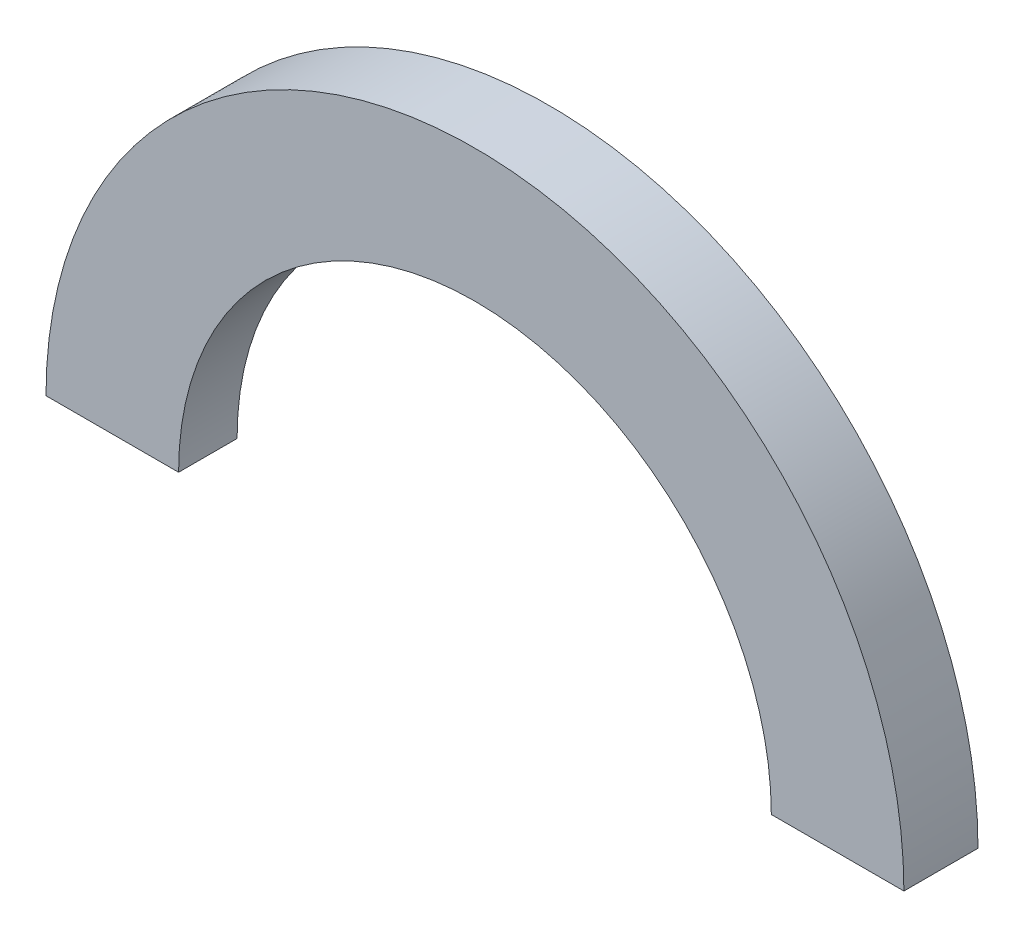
ISO-10303-21;
HEADER;
FILE_DESCRIPTION(('STEP AP214'),'2;1');
FILE_NAME('part.step','',(''),(''),'','','');
FILE_SCHEMA(('AUTOMOTIVE_DESIGN { 1 0 10303 214 1 1 1 1 }'));
ENDSEC;
DATA;
#1=APPLICATION_CONTEXT('core data for automotive mechanical design processes');
#2=APPLICATION_PROTOCOL_DEFINITION('international standard','automotive_design',2000,#1);
#3=PRODUCT_CONTEXT('',#1,'mechanical');
#4=PRODUCT('Part','Part','',(#3));
#5=PRODUCT_RELATED_PRODUCT_CATEGORY('part','',(#4));
#6=PRODUCT_DEFINITION_FORMATION('','',#4);
#7=PRODUCT_DEFINITION_CONTEXT('part definition',#1,'design');
#8=PRODUCT_DEFINITION('design','',#6,#7);
#9=PRODUCT_DEFINITION_SHAPE('','',#8);
#10=(LENGTH_UNIT() NAMED_UNIT(*) SI_UNIT(.MILLI.,.METRE.));
#11=(NAMED_UNIT(*) PLANE_ANGLE_UNIT() SI_UNIT($,.RADIAN.));
#12=(NAMED_UNIT(*) SI_UNIT($,.STERADIAN.) SOLID_ANGLE_UNIT());
#13=UNCERTAINTY_MEASURE_WITH_UNIT(LENGTH_MEASURE(1.E-05),#10,'distance_accuracy_value','');
#14=(GEOMETRIC_REPRESENTATION_CONTEXT(3) GLOBAL_UNCERTAINTY_ASSIGNED_CONTEXT((#13)) GLOBAL_UNIT_ASSIGNED_CONTEXT((#10,
#11,#12)) REPRESENTATION_CONTEXT('',''));
#15=CARTESIAN_POINT('',(0.,0.,0.));
#16=DIRECTION('',(0.,0.,1.));
#17=DIRECTION('',(1.,0.,0.));
#18=AXIS2_PLACEMENT_3D('',#15,#16,#17);
#19=CARTESIAN_POINT('',(0.,0.,0.));
#20=DIRECTION('',(0.,0.,1.));
#21=DIRECTION('',(1.,0.,0.));
#22=AXIS2_PLACEMENT_3D('',#19,#20,#21);
#23=PLANE('',#22);
#24=CARTESIAN_POINT('',(0.,0.,0.));
#25=DIRECTION('',(0.,0.,1.));
#26=DIRECTION('',(1.,0.,0.));
#27=AXIS2_PLACEMENT_3D('',#24,#25,#26);
#28=CIRCLE('',#27,55.);
#29=CARTESIAN_POINT('',(55.,0.,0.));
#30=VERTEX_POINT('',#29);
#31=CARTESIAN_POINT('',(-55.,0.,0.));
#32=VERTEX_POINT('',#31);
#33=EDGE_CURVE('E108',#30,#32,#28,.T.);
#34=ORIENTED_EDGE('',*,*,#33,.F.);
#35=DIRECTION('',(-1.,0.,0.));
#36=VECTOR('',#35,1.);
#37=CARTESIAN_POINT('',(-60.0066934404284,0.,0.));
#38=LINE('',#37,#36);
#39=CARTESIAN_POINT('',(41.,0.,0.));
#40=VERTEX_POINT('',#39);
#41=EDGE_CURVE('E88',#30,#40,#38,.T.);
#42=ORIENTED_EDGE('',*,*,#41,.T.);
#43=CARTESIAN_POINT('',(0.,0.,0.));
#44=DIRECTION('',(0.,0.,1.));
#45=DIRECTION('',(1.,0.,0.));
#46=AXIS2_PLACEMENT_3D('',#43,#44,#45);
#47=CIRCLE('',#46,41.);
#48=CARTESIAN_POINT('',(-41.,0.,0.));
#49=VERTEX_POINT('',#48);
#50=EDGE_CURVE('E93',#40,#49,#47,.T.);
#51=ORIENTED_EDGE('',*,*,#50,.T.);
#52=EDGE_CURVE('E104',#49,#32,#38,.T.);
#53=ORIENTED_EDGE('',*,*,#52,.T.);
#54=EDGE_LOOP('',(#34,#42,#51,#53));
#55=FACE_BOUND('',#54,.T.);
#56=ADVANCED_FACE('F33',(#55),#23,.F.);
#57=CARTESIAN_POINT('',(0.,0.,9.5));
#58=DIRECTION('',(0.,0.,1.));
#59=DIRECTION('',(1.,0.,0.));
#60=AXIS2_PLACEMENT_3D('',#57,#58,#59);
#61=PLANE('',#60);
#62=DIRECTION('',(-1.,0.,0.));
#63=VECTOR('',#62,1.);
#64=CARTESIAN_POINT('',(-60.0066934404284,0.,9.5));
#65=LINE('',#64,#63);
#66=CARTESIAN_POINT('',(55.,0.,9.5));
#67=VERTEX_POINT('',#66);
#68=CARTESIAN_POINT('',(38.,0.,9.5));
#69=VERTEX_POINT('',#68);
#70=EDGE_CURVE('E86',#67,#69,#65,.T.);
#71=ORIENTED_EDGE('',*,*,#70,.F.);
#72=CARTESIAN_POINT('',(0.,0.,9.5));
#73=DIRECTION('',(0.,0.,1.));
#74=DIRECTION('',(1.,0.,0.));
#75=AXIS2_PLACEMENT_3D('',#72,#73,#74);
#76=CIRCLE('',#75,55.);
#77=CARTESIAN_POINT('',(-55.,0.,9.5));
#78=VERTEX_POINT('',#77);
#79=EDGE_CURVE('E101',#67,#78,#76,.T.);
#80=ORIENTED_EDGE('',*,*,#79,.T.);
#81=CARTESIAN_POINT('',(-38.,0.,9.5));
#82=VERTEX_POINT('',#81);
#83=EDGE_CURVE('E105',#82,#78,#65,.T.);
#84=ORIENTED_EDGE('',*,*,#83,.F.);
#85=CARTESIAN_POINT('',(0.,0.,9.5));
#86=DIRECTION('',(0.,0.,1.));
#87=DIRECTION('',(1.,0.,0.));
#88=AXIS2_PLACEMENT_3D('',#85,#86,#87);
#89=CIRCLE('',#88,38.);
#90=EDGE_CURVE('E103',#69,#82,#89,.T.);
#91=ORIENTED_EDGE('',*,*,#90,.F.);
#92=EDGE_LOOP('',(#71,#80,#84,#91));
#93=FACE_BOUND('',#92,.T.);
#94=ADVANCED_FACE('F99',(#93),#61,.T.);
#95=CARTESIAN_POINT('',(0.,0.,9.5));
#96=DIRECTION('',(0.,0.,-1.));
#97=DIRECTION('',(-1.,0.,0.));
#98=AXIS2_PLACEMENT_3D('',#95,#96,#97);
#99=CYLINDRICAL_SURFACE('',#98,55.);
#100=ORIENTED_EDGE('',*,*,#79,.F.);
#101=DIRECTION('',(0.,0.,-1.));
#102=VECTOR('',#101,1.);
#103=CARTESIAN_POINT('',(55.,0.,9.5));
#104=LINE('',#103,#102);
#105=EDGE_CURVE('E83',#67,#30,#104,.T.);
#106=ORIENTED_EDGE('',*,*,#105,.T.);
#107=ORIENTED_EDGE('',*,*,#33,.T.);
#108=DIRECTION('',(0.,0.,-1.));
#109=VECTOR('',#108,1.);
#110=CARTESIAN_POINT('',(-55.,0.,9.5));
#111=LINE('',#110,#109);
#112=EDGE_CURVE('E94',#32,#78,#111,.F.);
#113=ORIENTED_EDGE('',*,*,#112,.T.);
#114=EDGE_LOOP('',(#100,#106,#107,#113));
#115=FACE_BOUND('',#114,.T.);
#116=ADVANCED_FACE('F35',(#115),#99,.T.);
#117=CARTESIAN_POINT('',(0.,0.,9.5));
#118=DIRECTION('',(0.,0.,-1.));
#119=DIRECTION('',(-1.,0.,0.));
#120=AXIS2_PLACEMENT_3D('',#117,#118,#119);
#121=CYLINDRICAL_SURFACE('',#120,38.);
#122=DIRECTION('',(0.,0.,-1.));
#123=VECTOR('',#122,1.);
#124=CARTESIAN_POINT('',(38.,0.,9.5));
#125=LINE('',#124,#123);
#126=CARTESIAN_POINT('',(38.,0.,2.));
#127=VERTEX_POINT('',#126);
#128=EDGE_CURVE('E56',#69,#127,#125,.T.);
#129=ORIENTED_EDGE('',*,*,#128,.F.);
#130=ORIENTED_EDGE('',*,*,#90,.T.);
#131=DIRECTION('',(0.,0.,-1.));
#132=VECTOR('',#131,1.);
#133=CARTESIAN_POINT('',(-38.,0.,9.5));
#134=LINE('',#133,#132);
#135=CARTESIAN_POINT('',(-38.,0.,2.));
#136=VERTEX_POINT('',#135);
#137=EDGE_CURVE('E129',#136,#82,#134,.F.);
#138=ORIENTED_EDGE('',*,*,#137,.F.);
#139=CARTESIAN_POINT('',(0.,0.,2.));
#140=DIRECTION('',(0.,0.,1.));
#141=DIRECTION('',(1.,0.,0.));
#142=AXIS2_PLACEMENT_3D('',#139,#140,#141);
#143=CIRCLE('',#142,38.);
#144=EDGE_CURVE('E112',#127,#136,#143,.T.);
#145=ORIENTED_EDGE('',*,*,#144,.F.);
#146=EDGE_LOOP('',(#129,#130,#138,#145));
#147=FACE_BOUND('',#146,.T.);
#148=ADVANCED_FACE('F140',(#147),#121,.F.);
#149=CARTESIAN_POINT('',(0.,0.,2.));
#150=DIRECTION('',(0.,0.,-1.));
#151=DIRECTION('',(-1.,0.,0.));
#152=AXIS2_PLACEMENT_3D('',#149,#150,#151);
#153=CYLINDRICAL_SURFACE('',#152,41.);
#154=DIRECTION('',(0.,0.,-1.));
#155=VECTOR('',#154,1.);
#156=CARTESIAN_POINT('',(41.,0.,2.));
#157=LINE('',#156,#155);
#158=CARTESIAN_POINT('',(41.,0.,2.));
#159=VERTEX_POINT('',#158);
#160=EDGE_CURVE('E127',#159,#40,#157,.T.);
#161=ORIENTED_EDGE('',*,*,#160,.F.);
#162=CARTESIAN_POINT('',(0.,0.,2.));
#163=DIRECTION('',(0.,0.,1.));
#164=DIRECTION('',(1.,0.,0.));
#165=AXIS2_PLACEMENT_3D('',#162,#163,#164);
#166=CIRCLE('',#165,41.);
#167=CARTESIAN_POINT('',(-41.,0.,2.));
#168=VERTEX_POINT('',#167);
#169=EDGE_CURVE('E114',#159,#168,#166,.T.);
#170=ORIENTED_EDGE('',*,*,#169,.T.);
#171=DIRECTION('',(0.,0.,-1.));
#172=VECTOR('',#171,1.);
#173=CARTESIAN_POINT('',(-41.,0.,2.));
#174=LINE('',#173,#172);
#175=EDGE_CURVE('E48',#49,#168,#174,.F.);
#176=ORIENTED_EDGE('',*,*,#175,.F.);
#177=ORIENTED_EDGE('',*,*,#50,.F.);
#178=EDGE_LOOP('',(#161,#170,#176,#177));
#179=FACE_BOUND('',#178,.T.);
#180=ADVANCED_FACE('F135',(#179),#153,.F.);
#181=CARTESIAN_POINT('',(0.,0.,2.));
#182=DIRECTION('',(0.,0.,1.));
#183=DIRECTION('',(1.,0.,0.));
#184=AXIS2_PLACEMENT_3D('',#181,#182,#183);
#185=PLANE('',#184);
#186=ORIENTED_EDGE('',*,*,#169,.F.);
#187=DIRECTION('',(-1.,0.,0.));
#188=VECTOR('',#187,1.);
#189=CARTESIAN_POINT('',(0.,0.,2.));
#190=LINE('',#189,#188);
#191=EDGE_CURVE('E11',#159,#127,#190,.T.);
#192=ORIENTED_EDGE('',*,*,#191,.T.);
#193=ORIENTED_EDGE('',*,*,#144,.T.);
#194=EDGE_CURVE('E37',#136,#168,#190,.T.);
#195=ORIENTED_EDGE('',*,*,#194,.T.);
#196=EDGE_LOOP('',(#186,#192,#193,#195));
#197=FACE_BOUND('',#196,.T.);
#198=ADVANCED_FACE('F136',(#197),#185,.F.);
#199=CARTESIAN_POINT('',(-60.0066934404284,0.,0.));
#200=DIRECTION('',(0.,1.,0.));
#201=DIRECTION('',(0.,0.,1.));
#202=AXIS2_PLACEMENT_3D('',#199,#200,#201);
#203=PLANE('',#202);
#204=ORIENTED_EDGE('',*,*,#52,.F.);
#205=ORIENTED_EDGE('',*,*,#175,.T.);
#206=ORIENTED_EDGE('',*,*,#194,.F.);
#207=ORIENTED_EDGE('',*,*,#137,.T.);
#208=ORIENTED_EDGE('',*,*,#83,.T.);
#209=ORIENTED_EDGE('',*,*,#112,.F.);
#210=EDGE_LOOP('',(#204,#205,#206,#207,#208,#209));
#211=FACE_BOUND('',#210,.T.);
#212=ADVANCED_FACE('F138',(#211),#203,.F.);
#213=ORIENTED_EDGE('',*,*,#70,.T.);
#214=ORIENTED_EDGE('',*,*,#128,.T.);
#215=ORIENTED_EDGE('',*,*,#191,.F.);
#216=ORIENTED_EDGE('',*,*,#160,.T.);
#217=ORIENTED_EDGE('',*,*,#41,.F.);
#218=ORIENTED_EDGE('',*,*,#105,.F.);
#219=EDGE_LOOP('',(#213,#214,#215,#216,#217,#218));
#220=FACE_BOUND('',#219,.T.);
#221=ADVANCED_FACE('F85',(#220),#203,.F.);
#222=CLOSED_SHELL('',(#56,#94,#116,#148,#180,#198,#212,#221));
#223=MANIFOLD_SOLID_BREP('B2',#222);
#224=ADVANCED_BREP_SHAPE_REPRESENTATION('',(#18,#223),#14);
#225=SHAPE_DEFINITION_REPRESENTATION(#9,#224);
ENDSEC;
END-ISO-10303-21;
